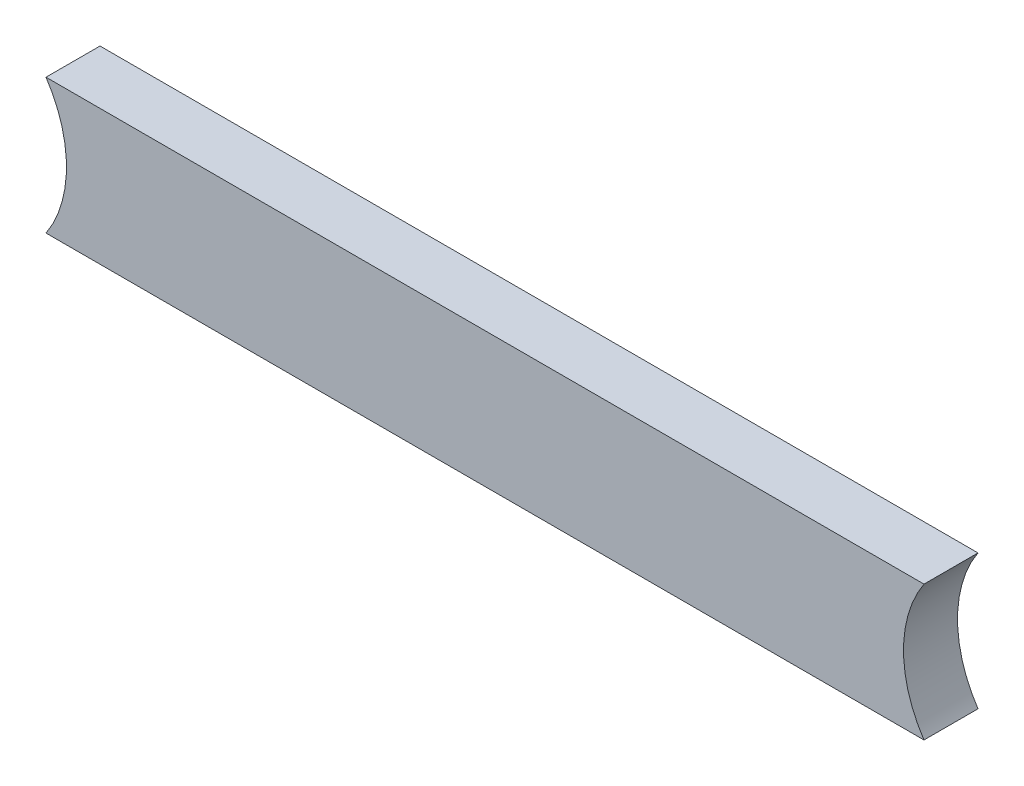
from build123d import *

# Parameters (mm, degrees)
BOSS_EXTRU_1_DEPTH = 10


with BuildPart() as part:
    # Esquisse1 → Boss.-Extru.1 (new body)
    with BuildSketch(Plane.XY):
        with BuildLine():
            Line((-81.291713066, 12.5), (81.291713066, 12.5))
            ThreePointArc((81.291713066, 12.5), (77.5, 0), (81.291713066, -12.5))
            Line((81.291713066, -12.5), (-81.291713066, -12.5))
            ThreePointArc((-81.291713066, -12.5), (-77.5, 0), (-81.291713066, 12.5))
        make_face()
    extrude(amount=BOSS_EXTRU_1_DEPTH)


solid = part.part
